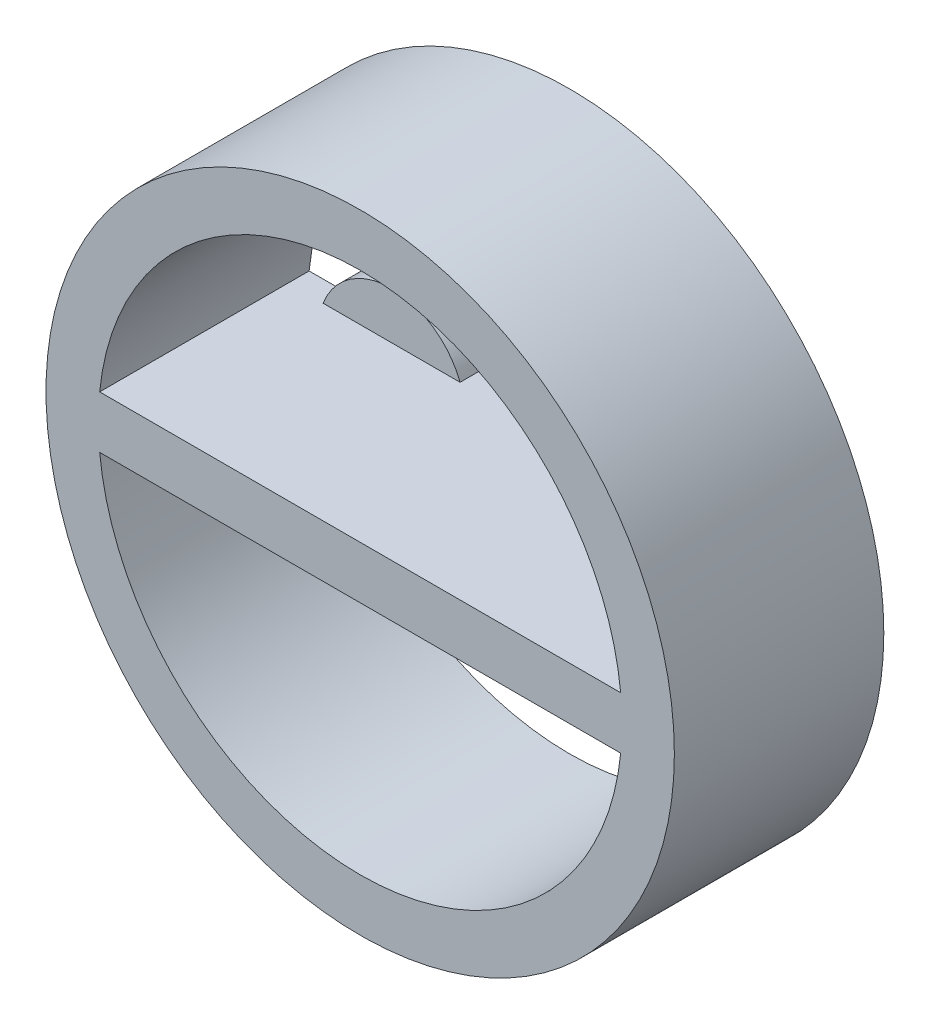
from build123d import *

# Parameters (mm, degrees)
ESQUISSE1_R        = 3
ESQUISSE1_R_2      = 2.5
BOSS_EXTRU_1_DEPTH = 2
ESQUISSE2_W        = 5.5
ESQUISSE2_H        = 0.5
BOSS_EXTRU_2_DEPTH = 2
ESQUISSE3_R        = 0.7
BOSS_EXTRU_3_DEPTH = 0.2
ESQUISSE4_R        = 0.7
BOSS_EXTRU_4_DEPTH = 0.2


with BuildPart() as part:
    # Esquisse1 → Boss.-Extru.1 (new body)
    with BuildSketch(Plane.XY):
        Circle(ESQUISSE1_R)
        Circle(ESQUISSE1_R_2, mode=Mode.SUBTRACT)
    extrude(amount=BOSS_EXTRU_1_DEPTH)

    # Esquisse2 → Boss.-Extru.2 (add)
    with BuildSketch(Plane.XY):
        Rectangle(ESQUISSE2_W, ESQUISSE2_H)
    extrude(amount=BOSS_EXTRU_2_DEPTH)

    # Esquisse3 → Boss.-Extru.3 (add)
    with BuildSketch(Plane.XY):
        with Locations((1.5, 0)):
            Circle(ESQUISSE3_R)
    extrude(amount=BOSS_EXTRU_3_DEPTH)

    # Esquisse4 → Boss.-Extru.4 (add)
    with BuildSketch(Plane.XY):
        with Locations((-1.5, 0)):
            Circle(ESQUISSE4_R)
    extrude(amount=BOSS_EXTRU_4_DEPTH)


solid = part.part
